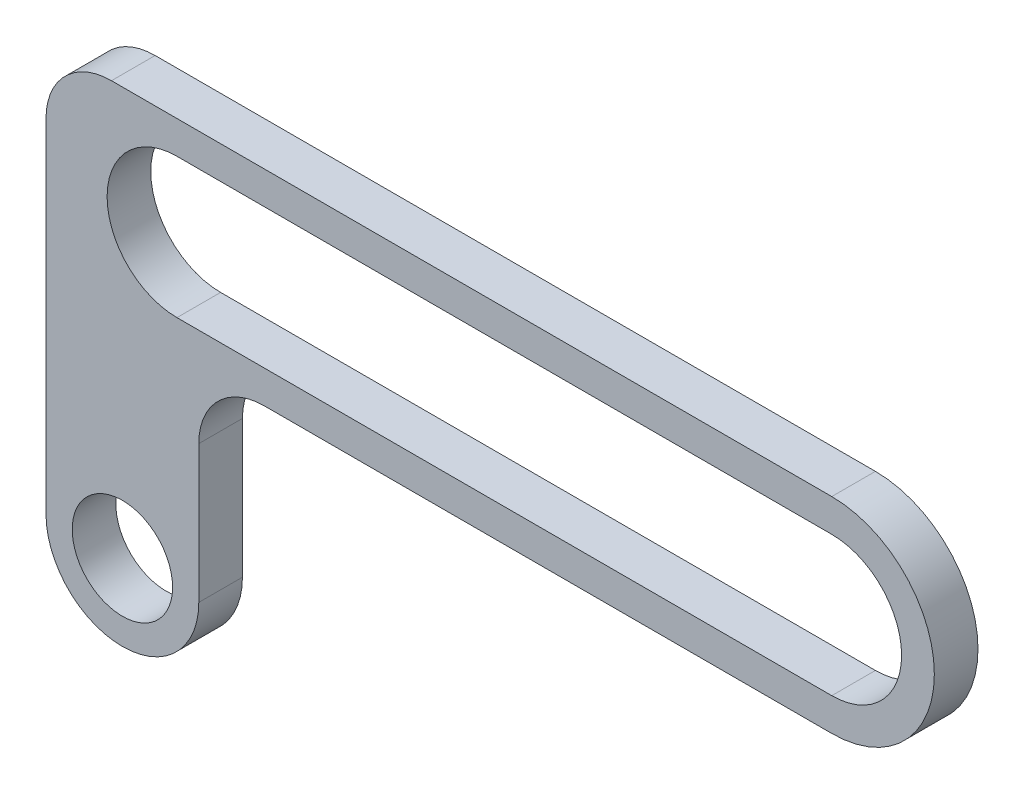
ISO-10303-21;
HEADER;
FILE_DESCRIPTION(('STEP AP214'),'2;1');
FILE_NAME('part.step','',(''),(''),'','','');
FILE_SCHEMA(('AUTOMOTIVE_DESIGN { 1 0 10303 214 1 1 1 1 }'));
ENDSEC;
DATA;
#1=APPLICATION_CONTEXT('core data for automotive mechanical design processes');
#2=APPLICATION_PROTOCOL_DEFINITION('international standard','automotive_design',2000,#1);
#3=PRODUCT_CONTEXT('',#1,'mechanical');
#4=PRODUCT('Part','Part','',(#3));
#5=PRODUCT_RELATED_PRODUCT_CATEGORY('part','',(#4));
#6=PRODUCT_DEFINITION_FORMATION('','',#4);
#7=PRODUCT_DEFINITION_CONTEXT('part definition',#1,'design');
#8=PRODUCT_DEFINITION('design','',#6,#7);
#9=PRODUCT_DEFINITION_SHAPE('','',#8);
#10=(LENGTH_UNIT() NAMED_UNIT(*) SI_UNIT(.MILLI.,.METRE.));
#11=(NAMED_UNIT(*) PLANE_ANGLE_UNIT() SI_UNIT($,.RADIAN.));
#12=(NAMED_UNIT(*) SI_UNIT($,.STERADIAN.) SOLID_ANGLE_UNIT());
#13=UNCERTAINTY_MEASURE_WITH_UNIT(LENGTH_MEASURE(1.E-05),#10,'distance_accuracy_value','');
#14=(GEOMETRIC_REPRESENTATION_CONTEXT(3) GLOBAL_UNCERTAINTY_ASSIGNED_CONTEXT((#13)) GLOBAL_UNIT_ASSIGNED_CONTEXT((#10,
#11,#12)) REPRESENTATION_CONTEXT('',''));
#15=CARTESIAN_POINT('',(0.,0.,0.));
#16=DIRECTION('',(0.,0.,1.));
#17=DIRECTION('',(1.,0.,0.));
#18=AXIS2_PLACEMENT_3D('',#15,#16,#17);
#19=CARTESIAN_POINT('',(0.,0.,20.));
#20=DIRECTION('',(0.,0.,1.));
#21=DIRECTION('',(1.,0.,0.));
#22=AXIS2_PLACEMENT_3D('',#19,#20,#21);
#23=PLANE('',#22);
#24=DIRECTION('',(-1.,0.,0.));
#25=VECTOR('',#24,1.);
#26=CARTESIAN_POINT('',(-35.,187.,20.));
#27=LINE('',#26,#25);
#28=CARTESIAN_POINT('',(325.,187.,20.));
#29=VERTEX_POINT('',#28);
#30=CARTESIAN_POINT('',(-5.,187.,20.));
#31=VERTEX_POINT('',#30);
#32=EDGE_CURVE('E182',#29,#31,#27,.T.);
#33=ORIENTED_EDGE('',*,*,#32,.T.);
#34=CARTESIAN_POINT('',(-4.99999999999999,157.,20.));
#35=DIRECTION('',(0.,0.,1.));
#36=DIRECTION('',(1.,0.,0.));
#37=AXIS2_PLACEMENT_3D('',#34,#35,#36);
#38=CIRCLE('',#37,30.);
#39=CARTESIAN_POINT('',(-35.,157.,20.));
#40=VERTEX_POINT('',#39);
#41=EDGE_CURVE('E220',#31,#40,#38,.T.);
#42=ORIENTED_EDGE('',*,*,#41,.T.);
#43=DIRECTION('',(0.,-1.,0.));
#44=VECTOR('',#43,1.);
#45=CARTESIAN_POINT('',(-35.,0.,20.));
#46=LINE('',#45,#44);
#47=CARTESIAN_POINT('',(-35.,0.,20.));
#48=VERTEX_POINT('',#47);
#49=EDGE_CURVE('E184',#40,#48,#46,.T.);
#50=ORIENTED_EDGE('',*,*,#49,.T.);
#51=CARTESIAN_POINT('',(0.,0.,20.));
#52=DIRECTION('',(0.,0.,1.));
#53=DIRECTION('',(1.,0.,0.));
#54=AXIS2_PLACEMENT_3D('',#51,#52,#53);
#55=CIRCLE('',#54,35.);
#56=CARTESIAN_POINT('',(35.,0.,20.));
#57=VERTEX_POINT('',#56);
#58=EDGE_CURVE('E171',#48,#57,#55,.T.);
#59=ORIENTED_EDGE('',*,*,#58,.T.);
#60=DIRECTION('',(0.,1.,0.));
#61=VECTOR('',#60,1.);
#62=CARTESIAN_POINT('',(35.,93.,20.));
#63=LINE('',#62,#61);
#64=CARTESIAN_POINT('',(35.,63.,20.));
#65=VERTEX_POINT('',#64);
#66=EDGE_CURVE('E174',#57,#65,#63,.T.);
#67=ORIENTED_EDGE('',*,*,#66,.T.);
#68=CARTESIAN_POINT('',(64.9999999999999,63.,20.));
#69=DIRECTION('',(0.,0.,1.));
#70=DIRECTION('',(1.,0.,0.));
#71=AXIS2_PLACEMENT_3D('',#68,#69,#70);
#72=CIRCLE('',#71,30.);
#73=CARTESIAN_POINT('',(64.9999999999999,93.,20.));
#74=VERTEX_POINT('',#73);
#75=EDGE_CURVE('E11',#65,#74,#72,.F.);
#76=ORIENTED_EDGE('',*,*,#75,.T.);
#77=DIRECTION('',(1.,0.,0.));
#78=VECTOR('',#77,1.);
#79=CARTESIAN_POINT('',(325.,93.0000000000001,20.));
#80=LINE('',#79,#78);
#81=CARTESIAN_POINT('',(325.,93.,20.));
#82=VERTEX_POINT('',#81);
#83=EDGE_CURVE('E178',#74,#82,#80,.T.);
#84=ORIENTED_EDGE('',*,*,#83,.T.);
#85=CARTESIAN_POINT('',(325.,140.,20.));
#86=DIRECTION('',(0.,0.,1.));
#87=DIRECTION('',(1.,0.,0.));
#88=AXIS2_PLACEMENT_3D('',#85,#86,#87);
#89=CIRCLE('',#88,47.);
#90=EDGE_CURVE('E180',#82,#29,#89,.T.);
#91=ORIENTED_EDGE('',*,*,#90,.T.);
#92=EDGE_LOOP('',(#33,#42,#50,#59,#67,#76,#84,#91));
#93=FACE_BOUND('',#92,.T.);
#94=CARTESIAN_POINT('',(0.,0.,20.));
#95=DIRECTION('',(0.,0.,1.));
#96=DIRECTION('',(1.,0.,0.));
#97=AXIS2_PLACEMENT_3D('',#94,#95,#96);
#98=CIRCLE('',#97,23.);
#99=CARTESIAN_POINT('',(23.,0.,20.));
#100=VERTEX_POINT('',#99);
#101=EDGE_CURVE('E165',#100,#100,#98,.T.);
#102=ORIENTED_EDGE('',*,*,#101,.F.);
#103=EDGE_LOOP('',(#102));
#104=FACE_BOUND('',#103,.T.);
#105=DIRECTION('',(1.,0.,0.));
#106=VECTOR('',#105,1.);
#107=CARTESIAN_POINT('',(325.,108.,20.));
#108=LINE('',#107,#106);
#109=CARTESIAN_POINT('',(25.,108.,20.));
#110=VERTEX_POINT('',#109);
#111=CARTESIAN_POINT('',(325.,108.,20.));
#112=VERTEX_POINT('',#111);
#113=EDGE_CURVE('E134',#110,#112,#108,.T.);
#114=ORIENTED_EDGE('',*,*,#113,.F.);
#115=CARTESIAN_POINT('',(25.,140.,20.));
#116=DIRECTION('',(0.,0.,1.));
#117=DIRECTION('',(1.,0.,0.));
#118=AXIS2_PLACEMENT_3D('',#115,#116,#117);
#119=CIRCLE('',#118,32.);
#120=CARTESIAN_POINT('',(25.,172.,20.));
#121=VERTEX_POINT('',#120);
#122=EDGE_CURVE('E124',#121,#110,#119,.T.);
#123=ORIENTED_EDGE('',*,*,#122,.F.);
#124=DIRECTION('',(-1.,0.,0.));
#125=VECTOR('',#124,1.);
#126=CARTESIAN_POINT('',(25.,172.,20.));
#127=LINE('',#126,#125);
#128=CARTESIAN_POINT('',(325.,172.,20.));
#129=VERTEX_POINT('',#128);
#130=EDGE_CURVE('E149',#129,#121,#127,.T.);
#131=ORIENTED_EDGE('',*,*,#130,.F.);
#132=CARTESIAN_POINT('',(325.,140.,20.));
#133=DIRECTION('',(0.,0.,1.));
#134=DIRECTION('',(1.,0.,0.));
#135=AXIS2_PLACEMENT_3D('',#132,#133,#134);
#136=CIRCLE('',#135,32.);
#137=EDGE_CURVE('E147',#112,#129,#136,.T.);
#138=ORIENTED_EDGE('',*,*,#137,.F.);
#139=EDGE_LOOP('',(#114,#123,#131,#138));
#140=FACE_BOUND('',#139,.T.);
#141=ADVANCED_FACE('F33',(#93,#104,#140),#23,.T.);
#142=CARTESIAN_POINT('',(0.,0.,0.));
#143=DIRECTION('',(0.,0.,1.));
#144=DIRECTION('',(1.,0.,0.));
#145=AXIS2_PLACEMENT_3D('',#142,#143,#144);
#146=PLANE('',#145);
#147=CARTESIAN_POINT('',(0.,0.,0.));
#148=DIRECTION('',(0.,0.,1.));
#149=DIRECTION('',(1.,0.,0.));
#150=AXIS2_PLACEMENT_3D('',#147,#148,#149);
#151=CIRCLE('',#150,23.);
#152=CARTESIAN_POINT('',(23.,0.,0.));
#153=VERTEX_POINT('',#152);
#154=EDGE_CURVE('E142',#153,#153,#151,.T.);
#155=ORIENTED_EDGE('',*,*,#154,.T.);
#156=EDGE_LOOP('',(#155));
#157=FACE_BOUND('',#156,.T.);
#158=DIRECTION('',(0.,-1.,0.));
#159=VECTOR('',#158,1.);
#160=CARTESIAN_POINT('',(-35.,0.,0.));
#161=LINE('',#160,#159);
#162=CARTESIAN_POINT('',(-35.,157.,0.));
#163=VERTEX_POINT('',#162);
#164=CARTESIAN_POINT('',(-35.,0.,0.));
#165=VERTEX_POINT('',#164);
#166=EDGE_CURVE('E175',#163,#165,#161,.T.);
#167=ORIENTED_EDGE('',*,*,#166,.F.);
#168=CARTESIAN_POINT('',(-4.99999999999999,157.,0.));
#169=DIRECTION('',(0.,0.,1.));
#170=DIRECTION('',(1.,0.,0.));
#171=AXIS2_PLACEMENT_3D('',#168,#169,#170);
#172=CIRCLE('',#171,30.);
#173=CARTESIAN_POINT('',(-5.,187.,0.));
#174=VERTEX_POINT('',#173);
#175=EDGE_CURVE('E56',#163,#174,#172,.F.);
#176=ORIENTED_EDGE('',*,*,#175,.T.);
#177=DIRECTION('',(-1.,0.,0.));
#178=VECTOR('',#177,1.);
#179=CARTESIAN_POINT('',(-35.,187.,0.));
#180=LINE('',#179,#178);
#181=CARTESIAN_POINT('',(325.,187.,0.));
#182=VERTEX_POINT('',#181);
#183=EDGE_CURVE('E196',#182,#174,#180,.T.);
#184=ORIENTED_EDGE('',*,*,#183,.F.);
#185=CARTESIAN_POINT('',(325.,140.,0.));
#186=DIRECTION('',(0.,0.,1.));
#187=DIRECTION('',(1.,0.,0.));
#188=AXIS2_PLACEMENT_3D('',#185,#186,#187);
#189=CIRCLE('',#188,47.);
#190=CARTESIAN_POINT('',(325.,93.,0.));
#191=VERTEX_POINT('',#190);
#192=EDGE_CURVE('E194',#191,#182,#189,.T.);
#193=ORIENTED_EDGE('',*,*,#192,.F.);
#194=DIRECTION('',(1.,0.,0.));
#195=VECTOR('',#194,1.);
#196=CARTESIAN_POINT('',(325.,93.0000000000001,0.));
#197=LINE('',#196,#195);
#198=CARTESIAN_POINT('',(64.9999999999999,93.,0.));
#199=VERTEX_POINT('',#198);
#200=EDGE_CURVE('E192',#199,#191,#197,.T.);
#201=ORIENTED_EDGE('',*,*,#200,.F.);
#202=CARTESIAN_POINT('',(64.9999999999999,63.,0.));
#203=DIRECTION('',(0.,0.,1.));
#204=DIRECTION('',(1.,0.,0.));
#205=AXIS2_PLACEMENT_3D('',#202,#203,#204);
#206=CIRCLE('',#205,30.);
#207=CARTESIAN_POINT('',(35.,63.,0.));
#208=VERTEX_POINT('',#207);
#209=EDGE_CURVE('E41',#199,#208,#206,.T.);
#210=ORIENTED_EDGE('',*,*,#209,.T.);
#211=DIRECTION('',(0.,1.,0.));
#212=VECTOR('',#211,1.);
#213=CARTESIAN_POINT('',(35.,93.,0.));
#214=LINE('',#213,#212);
#215=CARTESIAN_POINT('',(35.,0.,0.));
#216=VERTEX_POINT('',#215);
#217=EDGE_CURVE('E189',#216,#208,#214,.T.);
#218=ORIENTED_EDGE('',*,*,#217,.F.);
#219=CARTESIAN_POINT('',(0.,0.,0.));
#220=DIRECTION('',(0.,0.,1.));
#221=DIRECTION('',(1.,0.,0.));
#222=AXIS2_PLACEMENT_3D('',#219,#220,#221);
#223=CIRCLE('',#222,35.);
#224=EDGE_CURVE('E168',#165,#216,#223,.T.);
#225=ORIENTED_EDGE('',*,*,#224,.F.);
#226=EDGE_LOOP('',(#167,#176,#184,#193,#201,#210,#218,#225));
#227=FACE_BOUND('',#226,.T.);
#228=CARTESIAN_POINT('',(25.,140.,0.));
#229=DIRECTION('',(0.,0.,1.));
#230=DIRECTION('',(1.,0.,0.));
#231=AXIS2_PLACEMENT_3D('',#228,#229,#230);
#232=CIRCLE('',#231,32.);
#233=CARTESIAN_POINT('',(25.,172.,0.));
#234=VERTEX_POINT('',#233);
#235=CARTESIAN_POINT('',(25.,108.,0.));
#236=VERTEX_POINT('',#235);
#237=EDGE_CURVE('E153',#234,#236,#232,.T.);
#238=ORIENTED_EDGE('',*,*,#237,.T.);
#239=DIRECTION('',(1.,0.,0.));
#240=VECTOR('',#239,1.);
#241=CARTESIAN_POINT('',(325.,108.,0.));
#242=LINE('',#241,#240);
#243=CARTESIAN_POINT('',(325.,108.,0.));
#244=VERTEX_POINT('',#243);
#245=EDGE_CURVE('E141',#236,#244,#242,.T.);
#246=ORIENTED_EDGE('',*,*,#245,.T.);
#247=CARTESIAN_POINT('',(325.,140.,0.));
#248=DIRECTION('',(0.,0.,1.));
#249=DIRECTION('',(1.,0.,0.));
#250=AXIS2_PLACEMENT_3D('',#247,#248,#249);
#251=CIRCLE('',#250,32.);
#252=CARTESIAN_POINT('',(325.,172.,0.));
#253=VERTEX_POINT('',#252);
#254=EDGE_CURVE('E156',#244,#253,#251,.T.);
#255=ORIENTED_EDGE('',*,*,#254,.T.);
#256=DIRECTION('',(-1.,0.,0.));
#257=VECTOR('',#256,1.);
#258=CARTESIAN_POINT('',(25.,172.,0.));
#259=LINE('',#258,#257);
#260=EDGE_CURVE('E135',#253,#234,#259,.T.);
#261=ORIENTED_EDGE('',*,*,#260,.T.);
#262=EDGE_LOOP('',(#238,#246,#255,#261));
#263=FACE_BOUND('',#262,.T.);
#264=ADVANCED_FACE('F222',(#157,#227,#263),#146,.F.);
#265=CARTESIAN_POINT('',(0.,0.,20.));
#266=DIRECTION('',(0.,0.,-1.));
#267=DIRECTION('',(-1.,0.,0.));
#268=AXIS2_PLACEMENT_3D('',#265,#266,#267);
#269=CYLINDRICAL_SURFACE('',#268,35.);
#270=ORIENTED_EDGE('',*,*,#224,.T.);
#271=DIRECTION('',(0.,0.,-1.));
#272=VECTOR('',#271,1.);
#273=CARTESIAN_POINT('',(35.,0.,20.));
#274=LINE('',#273,#272);
#275=EDGE_CURVE('E207',#57,#216,#274,.T.);
#276=ORIENTED_EDGE('',*,*,#275,.F.);
#277=ORIENTED_EDGE('',*,*,#58,.F.);
#278=DIRECTION('',(0.,0.,-1.));
#279=VECTOR('',#278,1.);
#280=CARTESIAN_POINT('',(-35.,0.,20.));
#281=LINE('',#280,#279);
#282=EDGE_CURVE('E186',#48,#165,#281,.T.);
#283=ORIENTED_EDGE('',*,*,#282,.T.);
#284=EDGE_LOOP('',(#270,#276,#277,#283));
#285=FACE_BOUND('',#284,.T.);
#286=ADVANCED_FACE('F252',(#285),#269,.T.);
#287=CARTESIAN_POINT('',(35.,93.,20.));
#288=DIRECTION('',(-1.,0.,0.));
#289=DIRECTION('',(0.,-1.,0.));
#290=AXIS2_PLACEMENT_3D('',#287,#288,#289);
#291=PLANE('',#290);
#292=ORIENTED_EDGE('',*,*,#217,.T.);
#293=DIRECTION('',(0.,0.,-1.));
#294=VECTOR('',#293,1.);
#295=CARTESIAN_POINT('',(35.,63.,20.));
#296=LINE('',#295,#294);
#297=EDGE_CURVE('E213',#208,#65,#296,.F.);
#298=ORIENTED_EDGE('',*,*,#297,.T.);
#299=ORIENTED_EDGE('',*,*,#66,.F.);
#300=ORIENTED_EDGE('',*,*,#275,.T.);
#301=EDGE_LOOP('',(#292,#298,#299,#300));
#302=FACE_BOUND('',#301,.T.);
#303=ADVANCED_FACE('F230',(#302),#291,.F.);
#304=CARTESIAN_POINT('',(325.,93.0000000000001,20.));
#305=DIRECTION('',(0.,1.,0.));
#306=DIRECTION('',(-1.,0.,0.));
#307=AXIS2_PLACEMENT_3D('',#304,#305,#306);
#308=PLANE('',#307);
#309=ORIENTED_EDGE('',*,*,#83,.F.);
#310=DIRECTION('',(0.,0.,-1.));
#311=VECTOR('',#310,1.);
#312=CARTESIAN_POINT('',(64.9999999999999,93.,0.));
#313=LINE('',#312,#311);
#314=EDGE_CURVE('E210',#74,#199,#313,.T.);
#315=ORIENTED_EDGE('',*,*,#314,.T.);
#316=ORIENTED_EDGE('',*,*,#200,.T.);
#317=DIRECTION('',(0.,0.,-1.));
#318=VECTOR('',#317,1.);
#319=CARTESIAN_POINT('',(325.,93.,20.));
#320=LINE('',#319,#318);
#321=EDGE_CURVE('E204',#82,#191,#320,.T.);
#322=ORIENTED_EDGE('',*,*,#321,.F.);
#323=EDGE_LOOP('',(#309,#315,#316,#322));
#324=FACE_BOUND('',#323,.T.);
#325=ADVANCED_FACE('F239',(#324),#308,.F.);
#326=CARTESIAN_POINT('',(325.,140.,20.));
#327=DIRECTION('',(0.,0.,-1.));
#328=DIRECTION('',(-1.,0.,0.));
#329=AXIS2_PLACEMENT_3D('',#326,#327,#328);
#330=CYLINDRICAL_SURFACE('',#329,47.);
#331=ORIENTED_EDGE('',*,*,#192,.T.);
#332=DIRECTION('',(0.,0.,-1.));
#333=VECTOR('',#332,1.);
#334=CARTESIAN_POINT('',(325.,187.,20.));
#335=LINE('',#334,#333);
#336=EDGE_CURVE('E201',#29,#182,#335,.T.);
#337=ORIENTED_EDGE('',*,*,#336,.F.);
#338=ORIENTED_EDGE('',*,*,#90,.F.);
#339=ORIENTED_EDGE('',*,*,#321,.T.);
#340=EDGE_LOOP('',(#331,#337,#338,#339));
#341=FACE_BOUND('',#340,.T.);
#342=ADVANCED_FACE('F243',(#341),#330,.T.);
#343=CARTESIAN_POINT('',(-35.,187.,20.));
#344=DIRECTION('',(0.,-1.,0.));
#345=DIRECTION('',(0.,0.,-1.));
#346=AXIS2_PLACEMENT_3D('',#343,#344,#345);
#347=PLANE('',#346);
#348=ORIENTED_EDGE('',*,*,#183,.T.);
#349=DIRECTION('',(0.,0.,-1.));
#350=VECTOR('',#349,1.);
#351=CARTESIAN_POINT('',(-4.99999999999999,187.,20.));
#352=LINE('',#351,#350);
#353=EDGE_CURVE('E48',#174,#31,#352,.F.);
#354=ORIENTED_EDGE('',*,*,#353,.T.);
#355=ORIENTED_EDGE('',*,*,#32,.F.);
#356=ORIENTED_EDGE('',*,*,#336,.T.);
#357=EDGE_LOOP('',(#348,#354,#355,#356));
#358=FACE_BOUND('',#357,.T.);
#359=ADVANCED_FACE('F273',(#358),#347,.F.);
#360=CARTESIAN_POINT('',(-35.,0.,20.));
#361=DIRECTION('',(1.,0.,0.));
#362=DIRECTION('',(0.,1.,0.));
#363=AXIS2_PLACEMENT_3D('',#360,#361,#362);
#364=PLANE('',#363);
#365=ORIENTED_EDGE('',*,*,#49,.F.);
#366=DIRECTION('',(0.,0.,-1.));
#367=VECTOR('',#366,1.);
#368=CARTESIAN_POINT('',(-35.,157.,20.));
#369=LINE('',#368,#367);
#370=EDGE_CURVE('E215',#40,#163,#369,.T.);
#371=ORIENTED_EDGE('',*,*,#370,.T.);
#372=ORIENTED_EDGE('',*,*,#166,.T.);
#373=ORIENTED_EDGE('',*,*,#282,.F.);
#374=EDGE_LOOP('',(#365,#371,#372,#373));
#375=FACE_BOUND('',#374,.T.);
#376=ADVANCED_FACE('F249',(#375),#364,.F.);
#377=CARTESIAN_POINT('',(0.,0.,20.));
#378=DIRECTION('',(0.,0.,-1.));
#379=DIRECTION('',(-1.,0.,0.));
#380=AXIS2_PLACEMENT_3D('',#377,#378,#379);
#381=CYLINDRICAL_SURFACE('',#380,23.);
#382=ORIENTED_EDGE('',*,*,#101,.T.);
#383=EDGE_LOOP('',(#382));
#384=FACE_BOUND('',#383,.T.);
#385=ORIENTED_EDGE('',*,*,#154,.F.);
#386=EDGE_LOOP('',(#385));
#387=FACE_BOUND('',#386,.T.);
#388=ADVANCED_FACE('F268',(#384,#387),#381,.F.);
#389=CARTESIAN_POINT('',(25.,140.,20.));
#390=DIRECTION('',(0.,0.,-1.));
#391=DIRECTION('',(-1.,0.,0.));
#392=AXIS2_PLACEMENT_3D('',#389,#390,#391);
#393=CYLINDRICAL_SURFACE('',#392,32.);
#394=ORIENTED_EDGE('',*,*,#237,.F.);
#395=DIRECTION('',(0.,0.,-1.));
#396=VECTOR('',#395,1.);
#397=CARTESIAN_POINT('',(25.,172.,20.));
#398=LINE('',#397,#396);
#399=EDGE_CURVE('E130',#121,#234,#398,.T.);
#400=ORIENTED_EDGE('',*,*,#399,.F.);
#401=ORIENTED_EDGE('',*,*,#122,.T.);
#402=DIRECTION('',(0.,0.,-1.));
#403=VECTOR('',#402,1.);
#404=CARTESIAN_POINT('',(25.,108.,20.));
#405=LINE('',#404,#403);
#406=EDGE_CURVE('E127',#110,#236,#405,.T.);
#407=ORIENTED_EDGE('',*,*,#406,.T.);
#408=EDGE_LOOP('',(#394,#400,#401,#407));
#409=FACE_BOUND('',#408,.T.);
#410=ADVANCED_FACE('F126',(#409),#393,.F.);
#411=CARTESIAN_POINT('',(325.,108.,20.));
#412=DIRECTION('',(0.,1.,0.));
#413=DIRECTION('',(-1.,0.,0.));
#414=AXIS2_PLACEMENT_3D('',#411,#412,#413);
#415=PLANE('',#414);
#416=ORIENTED_EDGE('',*,*,#245,.F.);
#417=ORIENTED_EDGE('',*,*,#406,.F.);
#418=ORIENTED_EDGE('',*,*,#113,.T.);
#419=DIRECTION('',(0.,0.,-1.));
#420=VECTOR('',#419,1.);
#421=CARTESIAN_POINT('',(325.,108.,20.));
#422=LINE('',#421,#420);
#423=EDGE_CURVE('E143',#112,#244,#422,.T.);
#424=ORIENTED_EDGE('',*,*,#423,.T.);
#425=EDGE_LOOP('',(#416,#417,#418,#424));
#426=FACE_BOUND('',#425,.T.);
#427=ADVANCED_FACE('F138',(#426),#415,.T.);
#428=CARTESIAN_POINT('',(325.,140.,20.));
#429=DIRECTION('',(0.,0.,-1.));
#430=DIRECTION('',(-1.,0.,0.));
#431=AXIS2_PLACEMENT_3D('',#428,#429,#430);
#432=CYLINDRICAL_SURFACE('',#431,32.);
#433=ORIENTED_EDGE('',*,*,#254,.F.);
#434=ORIENTED_EDGE('',*,*,#423,.F.);
#435=ORIENTED_EDGE('',*,*,#137,.T.);
#436=DIRECTION('',(0.,0.,-1.));
#437=VECTOR('',#436,1.);
#438=CARTESIAN_POINT('',(325.,172.,20.));
#439=LINE('',#438,#437);
#440=EDGE_CURVE('E162',#129,#253,#439,.T.);
#441=ORIENTED_EDGE('',*,*,#440,.T.);
#442=EDGE_LOOP('',(#433,#434,#435,#441));
#443=FACE_BOUND('',#442,.T.);
#444=ADVANCED_FACE('F313',(#443),#432,.F.);
#445=CARTESIAN_POINT('',(25.,172.,20.));
#446=DIRECTION('',(0.,-1.,0.));
#447=DIRECTION('',(1.,0.,0.));
#448=AXIS2_PLACEMENT_3D('',#445,#446,#447);
#449=PLANE('',#448);
#450=ORIENTED_EDGE('',*,*,#260,.F.);
#451=ORIENTED_EDGE('',*,*,#440,.F.);
#452=ORIENTED_EDGE('',*,*,#130,.T.);
#453=ORIENTED_EDGE('',*,*,#399,.T.);
#454=EDGE_LOOP('',(#450,#451,#452,#453));
#455=FACE_BOUND('',#454,.T.);
#456=ADVANCED_FACE('F320',(#455),#449,.T.);
#457=CARTESIAN_POINT('',(64.9999999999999,63.,20.));
#458=DIRECTION('',(0.,0.,1.));
#459=DIRECTION('',(1.,0.,0.));
#460=AXIS2_PLACEMENT_3D('',#457,#458,#459);
#461=CYLINDRICAL_SURFACE('',#460,30.);
#462=ORIENTED_EDGE('',*,*,#75,.F.);
#463=ORIENTED_EDGE('',*,*,#297,.F.);
#464=ORIENTED_EDGE('',*,*,#209,.F.);
#465=ORIENTED_EDGE('',*,*,#314,.F.);
#466=EDGE_LOOP('',(#462,#463,#464,#465));
#467=FACE_BOUND('',#466,.T.);
#468=ADVANCED_FACE('F233',(#467),#461,.F.);
#469=CARTESIAN_POINT('',(-4.99999999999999,157.,20.));
#470=DIRECTION('',(0.,0.,-1.));
#471=DIRECTION('',(-1.,0.,0.));
#472=AXIS2_PLACEMENT_3D('',#469,#470,#471);
#473=CYLINDRICAL_SURFACE('',#472,30.);
#474=ORIENTED_EDGE('',*,*,#41,.F.);
#475=ORIENTED_EDGE('',*,*,#353,.F.);
#476=ORIENTED_EDGE('',*,*,#175,.F.);
#477=ORIENTED_EDGE('',*,*,#370,.F.);
#478=EDGE_LOOP('',(#474,#475,#476,#477));
#479=FACE_BOUND('',#478,.T.);
#480=ADVANCED_FACE('F35',(#479),#473,.T.);
#481=CLOSED_SHELL('',(#141,#264,#286,#303,#325,#342,#359,#376,#388,#410,#427,#444,#456,#468,#480));
#482=MANIFOLD_SOLID_BREP('B2',#481);
#483=ADVANCED_BREP_SHAPE_REPRESENTATION('',(#18,#482),#14);
#484=SHAPE_DEFINITION_REPRESENTATION(#9,#483);
ENDSEC;
END-ISO-10303-21;
